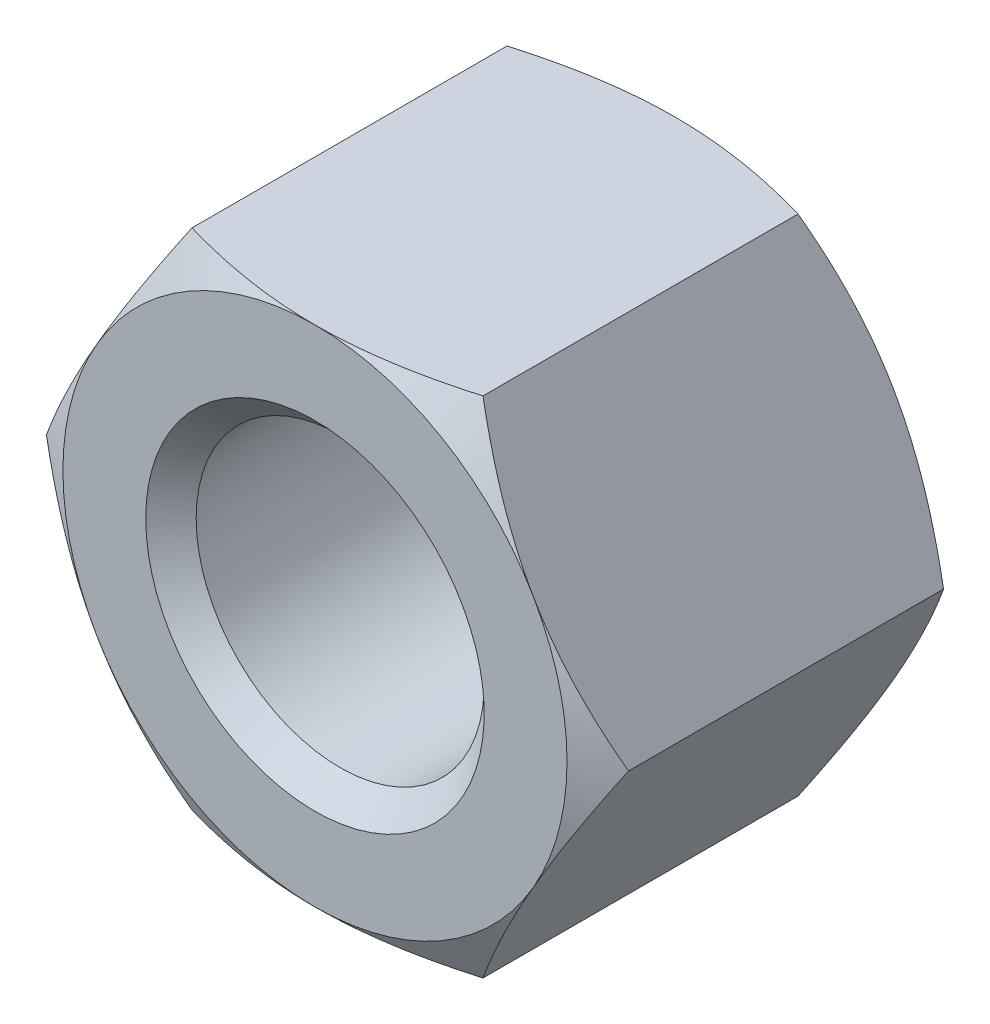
from build123d import *

# Parameters (mm, degrees)
BOSS_EXTRUDE1_DEPTH      = 2.5
SKETCH2_OUTSIDE_W        = 36.188
SKETCH2_OUTSIDE_H        = 35.106
SKETCH2_OUTSIDE_R        = 3.5
CUT_EXTRUDE1_DEPTH       = 6.90197707
CUT_EXTRUDE1_DRAFT       = -60
SKETCH3_R                = 2
SKETCH3_R_2              = 1.65
CUT_EXTRUDE2_DEPTH       = 2.5
SKETCH3_2_R              = 1.65
CUT_EXTRUDE3_DEPTH       = 3.55
CHAMFER1_SIZE            = 0.35
MIRROR1_COPY_1_SKETCH_W  = 36.188
MIRROR1_COPY_1_SKETCH_H  = 35.106
MIRROR1_COPY_1_SKETCH_R  = 3.5
MIRROR1_COPY_1_DEPTH     = 6.90197707
MIRROR1_COPY_1_DRAFT     = -60
CHAMFER1_OF_MIRROR1_SIZE = 0.35


with BuildPart() as part:
    # Sketch1 → Boss-Extrude1 (new body)
    with BuildSketch(Plane.XY):
        Polygon((2.020725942, 3.5), (-2.020725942, 3.5), (-4.041451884, 0), (-2.020725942, -3.5), (2.020725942, -3.5), (4.041451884, 0), align=None)
    boss_extrude1 = extrude(amount=-BOSS_EXTRUDE1_DEPTH)


with BuildPart() as cut_extrude1_tool:
    # Sketch2 outside → Cut-Extrude1 (with draft: the straight prism first)
    with BuildSketch(Plane(origin=(0, 0, -2.5), x_dir=(-1, 0, 0), z_dir=(0, 0, -1))):
        Rectangle(SKETCH2_OUTSIDE_W, SKETCH2_OUTSIDE_H)
        Circle(SKETCH2_OUTSIDE_R, mode=Mode.SUBTRACT)
    extrude(amount=-CUT_EXTRUDE1_DEPTH)
    # Cut-Extrude1: the draft: its side faces are tilted about the plane it starts from
    cut_extrude1_sides = [cut_extrude1_tool.faces().sort_by_distance(p)[0] for p in [
        (0, -17.553, 0.950988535),
        (-18.094, 0, 0.950988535),
        (0, 17.553, 0.950988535),
        (18.094, 0, 0.950988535),
        (3.5, 0, 0.950988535),
    ]]
    draft(cut_extrude1_sides, Plane(origin=(0, 0, -2.5), x_dir=(-1, 0, 0), z_dir=(0, 0, -1)), CUT_EXTRUDE1_DRAFT)


with BuildPart() as part_1:
    add(part.part)

    # Cut-Extrude1: cut by cut_extrude1_tool
    add(cut_extrude1_tool.part, mode=Mode.SUBTRACT)

    # Sketch3 → Cut-Extrude2 (cut)
    with BuildSketch(Plane(origin=(0, 0, -2.5), x_dir=(-1, 0, 0), z_dir=(0, 0, -1))):
        Circle(SKETCH3_R)
        Circle(SKETCH3_R_2, mode=Mode.SUBTRACT)
    cut_extrude2 = extrude(amount=-CUT_EXTRUDE2_DEPTH, mode=Mode.SUBTRACT)


with BuildPart() as cut_extrude2_piece_1:
    # of the separate pieces the step leaves, piece 1, a body of its own (cut_extrude2_pieces)
    add(part_1.part.solids().sort_by_distance((2.020725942, 3.5, 0))[0])

    # Chamfer1
    chamfer1_edges = [cut_extrude2_piece_1.edges().sort_by_distance(p)[0] for p in [
        (2, 0, -2.5),
    ]]
    chamfer(chamfer1_edges, length=CHAMFER1_SIZE)


with BuildPart() as cut_extrude2_piece_2:
    # of the separate pieces the step leaves, piece 2, a body of its own (cut_extrude2_pieces)
    add(part_1.part.solids().sort_by_distance((-1.65, 0, 0))[0])

    # Sketch3_2 → Cut-Extrude3 (cut)
    with BuildSketch(Plane(origin=(0, 0, -2.5), x_dir=(-1, 0, 0), z_dir=(0, 0, -1))):
        Circle(SKETCH3_2_R)
    cut_extrude3 = extrude(amount=-CUT_EXTRUDE3_DEPTH, mode=Mode.SUBTRACT)


with BuildPart() as cut_extrude2_piece_1_1:
    add(cut_extrude2_piece_1.part)

    # Mirror1: Boss-Extrude1, Cut-Extrude2, Cut-Extrude3 across plane
    add(boss_extrude1.mirror(Plane.XY))
    add(cut_extrude2.mirror(Plane.XY), mode=Mode.SUBTRACT)
    add(cut_extrude3.mirror(Plane.XY), mode=Mode.SUBTRACT)


with BuildPart() as mirror1_copy_1_tool:
    # Mirror1 copy 1 sketch → Mirror1 copy 1 (with draft: the straight prism first)
    with BuildSketch(Plane(origin=(0, 0, 2.5), x_dir=(-1, 0, 0), z_dir=(0, 0, 1))):
        Rectangle(MIRROR1_COPY_1_SKETCH_W, MIRROR1_COPY_1_SKETCH_H)
        Circle(MIRROR1_COPY_1_SKETCH_R, mode=Mode.SUBTRACT)
    extrude(amount=-MIRROR1_COPY_1_DEPTH)
    # Mirror1 copy 1: the draft: its side faces are tilted about the plane it starts from
    mirror1_copy_1_sides = [mirror1_copy_1_tool.faces().sort_by_distance(p)[0] for p in [
        (0, -17.553, -0.950988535),
        (-18.094, 0, -0.950988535),
        (0, 17.553, -0.950988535),
        (18.094, 0, -0.950988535),
        (3.5, 0, -0.950988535),
    ]]
    draft(mirror1_copy_1_sides, Plane(origin=(0, 0, 2.5), x_dir=(-1, 0, 0), z_dir=(0, 0, 1)), MIRROR1_COPY_1_DRAFT)


with BuildPart() as cut_extrude2_piece_1_2:
    add(cut_extrude2_piece_1_1.part)

    # Mirror1 copy 1: cut by mirror1_copy_1_tool
    add(mirror1_copy_1_tool.part, mode=Mode.SUBTRACT)

    # Chamfer1 of Mirror1
    chamfer1_of_mirror1_edges = [cut_extrude2_piece_1_2.edges().sort_by_distance(p)[0] for p in [
        (2, 0, 2.5),
    ]]
    chamfer(chamfer1_of_mirror1_edges, length=CHAMFER1_OF_MIRROR1_SIZE)


solid = cut_extrude2_piece_1_2.part
